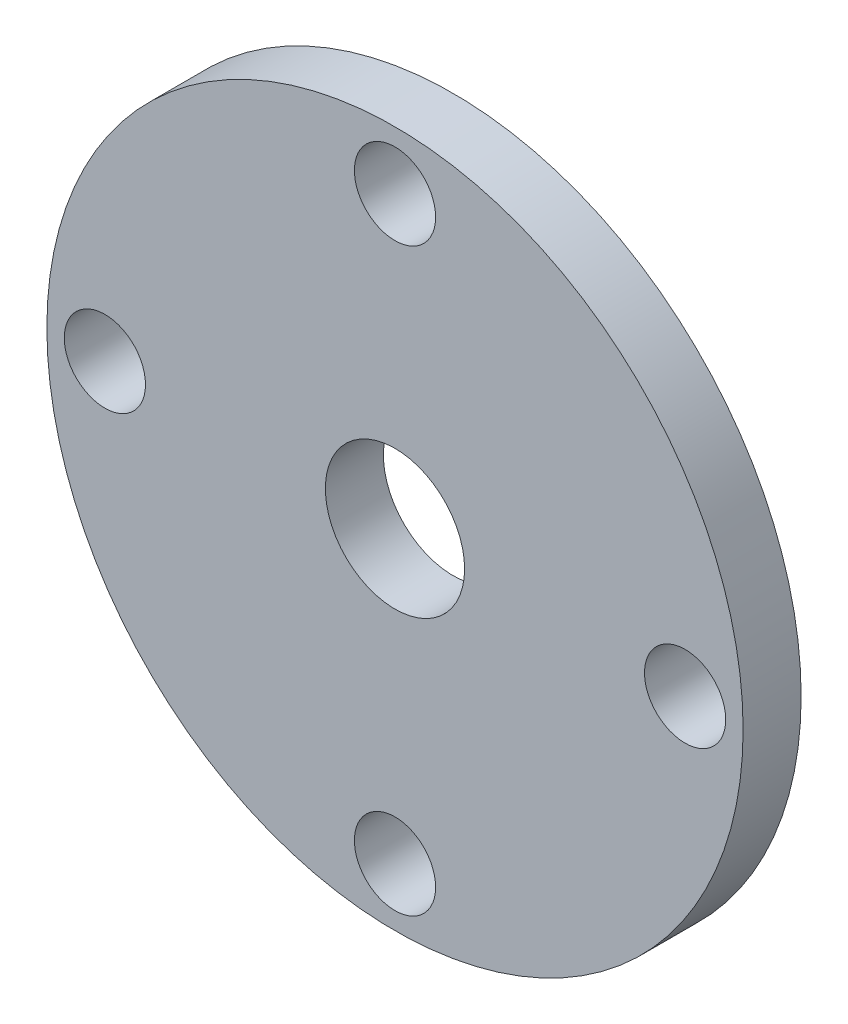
from build123d import *

# Parameters (mm, degrees)
SKETCH1_R           = 30
SKETCH1_R_2         = 6
SKETCH1_R_3         = 3.5
BOSS_EXTRUDE1_DEPTH = 5


with BuildPart() as part:
    # Sketch1 → Boss-Extrude1 (new body)
    with BuildSketch(Plane.XY):
        Circle(SKETCH1_R)
        Circle(SKETCH1_R_2, mode=Mode.SUBTRACT)
        with Locations((0, 25)):
            Circle(SKETCH1_R_3, mode=Mode.SUBTRACT)
        with Locations((25, 0)):
            Circle(SKETCH1_R_3, mode=Mode.SUBTRACT)
        with Locations((0, -25)):
            Circle(SKETCH1_R_3, mode=Mode.SUBTRACT)
        with Locations((-25, 0)):
            Circle(SKETCH1_R_3, mode=Mode.SUBTRACT)
    extrude(amount=BOSS_EXTRUDE1_DEPTH)


solid = part.part
